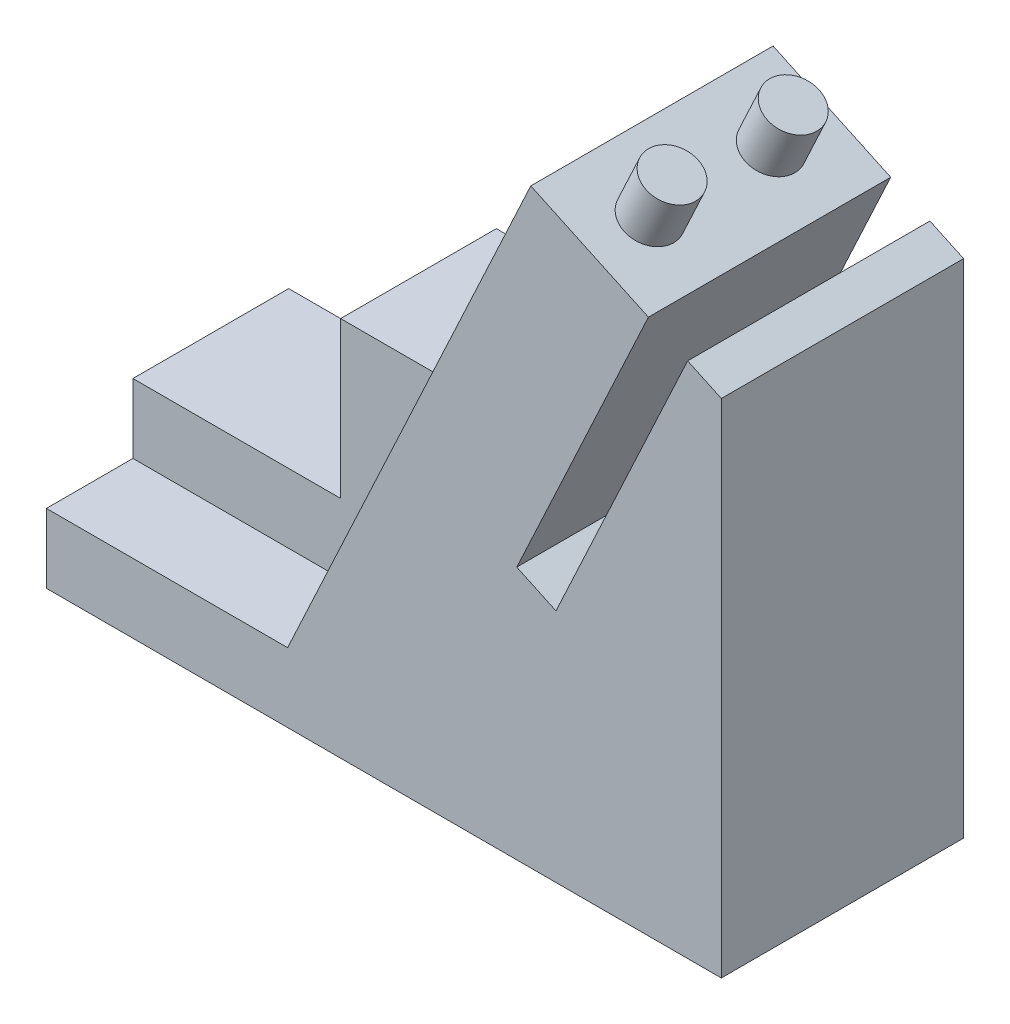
ISO-10303-21;
HEADER;
FILE_DESCRIPTION(('STEP AP214'),'2;1');
FILE_NAME('part.step','',(''),(''),'','','');
FILE_SCHEMA(('AUTOMOTIVE_DESIGN { 1 0 10303 214 1 1 1 1 }'));
ENDSEC;
DATA;
#1=APPLICATION_CONTEXT('core data for automotive mechanical design processes');
#2=APPLICATION_PROTOCOL_DEFINITION('international standard','automotive_design',2000,#1);
#3=PRODUCT_CONTEXT('',#1,'mechanical');
#4=PRODUCT('Part','Part','',(#3));
#5=PRODUCT_RELATED_PRODUCT_CATEGORY('part','',(#4));
#6=PRODUCT_DEFINITION_FORMATION('','',#4);
#7=PRODUCT_DEFINITION_CONTEXT('part definition',#1,'design');
#8=PRODUCT_DEFINITION('design','',#6,#7);
#9=PRODUCT_DEFINITION_SHAPE('','',#8);
#10=(LENGTH_UNIT() NAMED_UNIT(*) SI_UNIT(.MILLI.,.METRE.));
#11=(NAMED_UNIT(*) PLANE_ANGLE_UNIT() SI_UNIT($,.RADIAN.));
#12=(NAMED_UNIT(*) SI_UNIT($,.STERADIAN.) SOLID_ANGLE_UNIT());
#13=UNCERTAINTY_MEASURE_WITH_UNIT(LENGTH_MEASURE(1.E-05),#10,'distance_accuracy_value','');
#14=(GEOMETRIC_REPRESENTATION_CONTEXT(3) GLOBAL_UNCERTAINTY_ASSIGNED_CONTEXT((#13)) GLOBAL_UNIT_ASSIGNED_CONTEXT((#10,
#11,#12)) REPRESENTATION_CONTEXT('',''));
#15=CARTESIAN_POINT('',(0.,0.,0.));
#16=DIRECTION('',(0.,0.,1.));
#17=DIRECTION('',(1.,0.,0.));
#18=AXIS2_PLACEMENT_3D('',#15,#16,#17);
#19=CARTESIAN_POINT('',(78.,58.,28.));
#20=DIRECTION('',(-0.422618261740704,-0.906307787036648,0.));
#21=DIRECTION('',(0.906307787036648,-0.422618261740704,0.));
#22=AXIS2_PLACEMENT_3D('',#19,#20,#21);
#23=PLANE('',#22);
#24=CARTESIAN_POINT('',(62.7768771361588,65.0986587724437,21.));
#25=DIRECTION('',(-0.422618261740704,-0.906307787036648,0.));
#26=DIRECTION('',(0.906307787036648,-0.422618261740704,0.));
#27=AXIS2_PLACEMENT_3D('',#24,#25,#26);
#28=CIRCLE('',#27,2.99999999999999);
#29=CARTESIAN_POINT('',(65.4958004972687,63.8308039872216,21.));
#30=VERTEX_POINT('',#29);
#31=EDGE_CURVE('E11',#30,#30,#28,.F.);
#32=ORIENTED_EDGE('',*,*,#31,.F.);
#33=EDGE_LOOP('',(#32));
#34=FACE_BOUND('',#33,.T.);
#35=CARTESIAN_POINT('',(62.7768771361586,65.0986587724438,7.));
#36=DIRECTION('',(-0.422618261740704,-0.906307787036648,0.));
#37=DIRECTION('',(0.906307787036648,-0.422618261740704,0.));
#38=AXIS2_PLACEMENT_3D('',#35,#36,#37);
#39=CIRCLE('',#38,3.);
#40=CARTESIAN_POINT('',(65.4958004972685,63.8308039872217,7.));
#41=VERTEX_POINT('',#40);
#42=EDGE_CURVE('E52',#41,#41,#39,.F.);
#43=ORIENTED_EDGE('',*,*,#42,.F.);
#44=EDGE_LOOP('',(#43));
#45=FACE_BOUND('',#44,.T.);
#46=DIRECTION('',(-0.906307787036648,0.422618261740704,0.));
#47=VECTOR('',#46,1.);
#48=CARTESIAN_POINT('',(78.,58.,28.));
#49=LINE('',#48,#47);
#50=CARTESIAN_POINT('',(69.5741855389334,61.9290218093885,28.));
#51=VERTEX_POINT('',#50);
#52=CARTESIAN_POINT('',(55.9795687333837,68.2682957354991,28.));
#53=VERTEX_POINT('',#52);
#54=EDGE_CURVE('E219',#51,#53,#49,.T.);
#55=ORIENTED_EDGE('',*,*,#54,.F.);
#56=DIRECTION('',(0.,0.,1.));
#57=VECTOR('',#56,1.);
#58=CARTESIAN_POINT('',(69.5741855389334,61.9290218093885,-0.001000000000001));
#59=LINE('',#58,#57);
#60=CARTESIAN_POINT('',(69.5741855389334,61.9290218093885,0.));
#61=VERTEX_POINT('',#60);
#62=EDGE_CURVE('E200',#61,#51,#59,.T.);
#63=ORIENTED_EDGE('',*,*,#62,.F.);
#64=DIRECTION('',(-0.906307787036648,0.422618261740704,0.));
#65=VECTOR('',#64,1.);
#66=CARTESIAN_POINT('',(78.,58.,0.));
#67=LINE('',#66,#65);
#68=CARTESIAN_POINT('',(55.9795687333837,68.2682957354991,0.));
#69=VERTEX_POINT('',#68);
#70=EDGE_CURVE('E237',#61,#69,#67,.T.);
#71=ORIENTED_EDGE('',*,*,#70,.T.);
#72=DIRECTION('',(0.,0.,-1.));
#73=VECTOR('',#72,1.);
#74=CARTESIAN_POINT('',(55.9795687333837,68.2682957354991,28.));
#75=LINE('',#74,#73);
#76=EDGE_CURVE('E268',#53,#69,#75,.T.);
#77=ORIENTED_EDGE('',*,*,#76,.F.);
#78=EDGE_LOOP('',(#55,#63,#71,#77));
#79=FACE_BOUND('',#78,.T.);
#80=ADVANCED_FACE('F43',(#34,#45,#79),#23,.F.);
#81=CARTESIAN_POINT('',(0.,16.,28.));
#82=DIRECTION('',(1.,0.,0.));
#83=DIRECTION('',(0.,1.,0.));
#84=AXIS2_PLACEMENT_3D('',#81,#82,#83);
#85=PLANE('',#84);
#86=DIRECTION('',(0.,-1.,0.));
#87=VECTOR('',#86,1.);
#88=CARTESIAN_POINT('',(0.,16.,28.));
#89=LINE('',#88,#87);
#90=CARTESIAN_POINT('',(0.,8.,28.));
#91=VERTEX_POINT('',#90);
#92=CARTESIAN_POINT('',(0.,0.,28.));
#93=VERTEX_POINT('',#92);
#94=EDGE_CURVE('E167',#91,#93,#89,.T.);
#95=ORIENTED_EDGE('',*,*,#94,.F.);
#96=DIRECTION('',(0.,0.,1.));
#97=VECTOR('',#96,1.);
#98=CARTESIAN_POINT('',(0.,8.,18.));
#99=LINE('',#98,#97);
#100=CARTESIAN_POINT('',(0.,8.,18.));
#101=VERTEX_POINT('',#100);
#102=EDGE_CURVE('E59',#101,#91,#99,.T.);
#103=ORIENTED_EDGE('',*,*,#102,.F.);
#104=DIRECTION('',(0.,-1.,0.));
#105=VECTOR('',#104,1.);
#106=CARTESIAN_POINT('',(0.,8.,18.));
#107=LINE('',#106,#105);
#108=CARTESIAN_POINT('',(0.,16.,18.));
#109=VERTEX_POINT('',#108);
#110=EDGE_CURVE('E154',#109,#101,#107,.T.);
#111=ORIENTED_EDGE('',*,*,#110,.F.);
#112=DIRECTION('',(0.,0.,-1.));
#113=VECTOR('',#112,1.);
#114=CARTESIAN_POINT('',(0.,16.,28.));
#115=LINE('',#114,#113);
#116=CARTESIAN_POINT('',(0.,16.,0.));
#117=VERTEX_POINT('',#116);
#118=EDGE_CURVE('E227',#109,#117,#115,.T.);
#119=ORIENTED_EDGE('',*,*,#118,.T.);
#120=DIRECTION('',(0.,-1.,0.));
#121=VECTOR('',#120,1.);
#122=CARTESIAN_POINT('',(0.,16.,0.));
#123=LINE('',#122,#121);
#124=CARTESIAN_POINT('',(0.,0.,0.));
#125=VERTEX_POINT('',#124);
#126=EDGE_CURVE('E209',#117,#125,#123,.T.);
#127=ORIENTED_EDGE('',*,*,#126,.T.);
#128=DIRECTION('',(0.,0.,-1.));
#129=VECTOR('',#128,1.);
#130=CARTESIAN_POINT('',(0.,0.,28.));
#131=LINE('',#130,#129);
#132=EDGE_CURVE('E280',#93,#125,#131,.T.);
#133=ORIENTED_EDGE('',*,*,#132,.F.);
#134=EDGE_LOOP('',(#95,#103,#111,#119,#127,#133));
#135=FACE_BOUND('',#134,.T.);
#136=ADVANCED_FACE('F45',(#135),#85,.F.);
#137=CARTESIAN_POINT('',(0.,0.,28.));
#138=DIRECTION('',(0.,1.,0.));
#139=DIRECTION('',(0.,0.,1.));
#140=AXIS2_PLACEMENT_3D('',#137,#138,#139);
#141=PLANE('',#140);
#142=DIRECTION('',(1.,0.,0.));
#143=VECTOR('',#142,1.);
#144=CARTESIAN_POINT('',(0.,0.,0.));
#145=LINE('',#144,#143);
#146=CARTESIAN_POINT('',(78.,0.,0.));
#147=VERTEX_POINT('',#146);
#148=EDGE_CURVE('E231',#125,#147,#145,.T.);
#149=ORIENTED_EDGE('',*,*,#148,.T.);
#150=DIRECTION('',(0.,0.,-1.));
#151=VECTOR('',#150,1.);
#152=CARTESIAN_POINT('',(78.,0.,28.));
#153=LINE('',#152,#151);
#154=CARTESIAN_POINT('',(78.,0.,28.));
#155=VERTEX_POINT('',#154);
#156=EDGE_CURVE('E276',#155,#147,#153,.T.);
#157=ORIENTED_EDGE('',*,*,#156,.F.);
#158=DIRECTION('',(1.,0.,0.));
#159=VECTOR('',#158,1.);
#160=CARTESIAN_POINT('',(0.,0.,28.));
#161=LINE('',#160,#159);
#162=EDGE_CURVE('E212',#93,#155,#161,.T.);
#163=ORIENTED_EDGE('',*,*,#162,.F.);
#164=ORIENTED_EDGE('',*,*,#132,.T.);
#165=EDGE_LOOP('',(#149,#157,#163,#164));
#166=FACE_BOUND('',#165,.T.);
#167=ADVANCED_FACE('F391',(#166),#141,.F.);
#168=CARTESIAN_POINT('',(78.,0.,28.));
#169=DIRECTION('',(-1.,0.,0.));
#170=DIRECTION('',(0.,0.,1.));
#171=AXIS2_PLACEMENT_3D('',#168,#169,#170);
#172=PLANE('',#171);
#173=DIRECTION('',(0.,1.,0.));
#174=VECTOR('',#173,1.);
#175=CARTESIAN_POINT('',(78.,0.,0.));
#176=LINE('',#175,#174);
#177=CARTESIAN_POINT('',(78.,58.,0.));
#178=VERTEX_POINT('',#177);
#179=EDGE_CURVE('E234',#147,#178,#176,.T.);
#180=ORIENTED_EDGE('',*,*,#179,.T.);
#181=DIRECTION('',(0.,0.,-1.));
#182=VECTOR('',#181,1.);
#183=CARTESIAN_POINT('',(78.,58.,28.));
#184=LINE('',#183,#182);
#185=CARTESIAN_POINT('',(78.,58.,28.));
#186=VERTEX_POINT('',#185);
#187=EDGE_CURVE('E272',#186,#178,#184,.T.);
#188=ORIENTED_EDGE('',*,*,#187,.F.);
#189=DIRECTION('',(0.,1.,0.));
#190=VECTOR('',#189,1.);
#191=CARTESIAN_POINT('',(78.,0.,28.));
#192=LINE('',#191,#190);
#193=EDGE_CURVE('E216',#155,#186,#192,.T.);
#194=ORIENTED_EDGE('',*,*,#193,.F.);
#195=ORIENTED_EDGE('',*,*,#156,.T.);
#196=EDGE_LOOP('',(#180,#188,#194,#195));
#197=FACE_BOUND('',#196,.T.);
#198=ADVANCED_FACE('F388',(#197),#172,.F.);
#199=CARTESIAN_POINT('',(74.1057244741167,59.815930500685,0.));
#200=VERTEX_POINT('',#199);
#201=EDGE_CURVE('E238',#178,#200,#67,.T.);
#202=ORIENTED_EDGE('',*,*,#201,.T.);
#203=DIRECTION('',(0.,0.,1.));
#204=VECTOR('',#203,1.);
#205=CARTESIAN_POINT('',(74.1057244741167,59.815930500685,-0.001000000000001));
#206=LINE('',#205,#204);
#207=CARTESIAN_POINT('',(74.1057244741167,59.815930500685,28.));
#208=VERTEX_POINT('',#207);
#209=EDGE_CURVE('E67',#200,#208,#206,.T.);
#210=ORIENTED_EDGE('',*,*,#209,.T.);
#211=EDGE_CURVE('E220',#186,#208,#49,.T.);
#212=ORIENTED_EDGE('',*,*,#211,.F.);
#213=ORIENTED_EDGE('',*,*,#187,.T.);
#214=EDGE_LOOP('',(#202,#210,#212,#213));
#215=FACE_BOUND('',#214,.T.);
#216=ADVANCED_FACE('F293',(#215),#23,.F.);
#217=CARTESIAN_POINT('',(55.9795687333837,68.2682957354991,28.));
#218=DIRECTION('',(0.906307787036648,-0.422618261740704,0.));
#219=DIRECTION('',(0.422618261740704,0.906307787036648,0.));
#220=AXIS2_PLACEMENT_3D('',#217,#218,#219);
#221=PLANE('',#220);
#222=DIRECTION('',(-0.422618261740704,-0.906307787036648,0.));
#223=VECTOR('',#222,1.);
#224=CARTESIAN_POINT('',(55.9795687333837,68.2682957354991,0.));
#225=LINE('',#224,#223);
#226=CARTESIAN_POINT('',(40.,34.,0.));
#227=VERTEX_POINT('',#226);
#228=EDGE_CURVE('E242',#69,#227,#225,.T.);
#229=ORIENTED_EDGE('',*,*,#228,.T.);
#230=DIRECTION('',(0.,0.,-1.));
#231=VECTOR('',#230,1.);
#232=CARTESIAN_POINT('',(40.,34.,28.));
#233=LINE('',#232,#231);
#234=CARTESIAN_POINT('',(40.,34.,18.));
#235=VERTEX_POINT('',#234);
#236=EDGE_CURVE('E265',#235,#227,#233,.T.);
#237=ORIENTED_EDGE('',*,*,#236,.F.);
#238=DIRECTION('',(0.422618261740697,0.906307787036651,0.));
#239=VECTOR('',#238,1.);
#240=CARTESIAN_POINT('',(27.8760008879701,8.,18.));
#241=LINE('',#240,#239);
#242=CARTESIAN_POINT('',(27.8760008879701,8.,18.));
#243=VERTEX_POINT('',#242);
#244=EDGE_CURVE('E153',#243,#235,#241,.T.);
#245=ORIENTED_EDGE('',*,*,#244,.F.);
#246=DIRECTION('',(0.,0.,1.));
#247=VECTOR('',#246,1.);
#248=CARTESIAN_POINT('',(27.8760008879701,8.,18.));
#249=LINE('',#248,#247);
#250=CARTESIAN_POINT('',(27.8760008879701,8.,28.));
#251=VERTEX_POINT('',#250);
#252=EDGE_CURVE('E149',#243,#251,#249,.T.);
#253=ORIENTED_EDGE('',*,*,#252,.T.);
#254=DIRECTION('',(-0.422618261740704,-0.906307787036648,0.));
#255=VECTOR('',#254,1.);
#256=CARTESIAN_POINT('',(55.9795687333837,68.2682957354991,28.));
#257=LINE('',#256,#255);
#258=EDGE_CURVE('E224',#53,#251,#257,.T.);
#259=ORIENTED_EDGE('',*,*,#258,.F.);
#260=ORIENTED_EDGE('',*,*,#76,.T.);
#261=EDGE_LOOP('',(#229,#237,#245,#253,#259,#260));
#262=FACE_BOUND('',#261,.T.);
#263=ADVANCED_FACE('F307',(#262),#221,.F.);
#264=CARTESIAN_POINT('',(40.,34.,28.));
#265=DIRECTION('',(0.,-1.,0.));
#266=DIRECTION('',(0.,0.,-1.));
#267=AXIS2_PLACEMENT_3D('',#264,#265,#266);
#268=PLANE('',#267);
#269=DIRECTION('',(0.,0.,-1.));
#270=VECTOR('',#269,1.);
#271=CARTESIAN_POINT('',(24.,34.,28.));
#272=LINE('',#271,#270);
#273=CARTESIAN_POINT('',(24.,34.,18.));
#274=VERTEX_POINT('',#273);
#275=CARTESIAN_POINT('',(24.,34.,0.));
#276=VERTEX_POINT('',#275);
#277=EDGE_CURVE('E262',#274,#276,#272,.T.);
#278=ORIENTED_EDGE('',*,*,#277,.F.);
#279=DIRECTION('',(-1.,0.,0.));
#280=VECTOR('',#279,1.);
#281=CARTESIAN_POINT('',(24.,34.,18.));
#282=LINE('',#281,#280);
#283=EDGE_CURVE('E317',#235,#274,#282,.T.);
#284=ORIENTED_EDGE('',*,*,#283,.F.);
#285=ORIENTED_EDGE('',*,*,#236,.T.);
#286=DIRECTION('',(-1.,0.,0.));
#287=VECTOR('',#286,1.);
#288=CARTESIAN_POINT('',(40.,34.,0.));
#289=LINE('',#288,#287);
#290=EDGE_CURVE('E246',#227,#276,#289,.T.);
#291=ORIENTED_EDGE('',*,*,#290,.T.);
#292=EDGE_LOOP('',(#278,#284,#285,#291));
#293=FACE_BOUND('',#292,.T.);
#294=ADVANCED_FACE('F315',(#293),#268,.F.);
#295=CARTESIAN_POINT('',(24.,34.,28.));
#296=DIRECTION('',(1.,0.,0.));
#297=DIRECTION('',(0.,0.,-1.));
#298=AXIS2_PLACEMENT_3D('',#295,#296,#297);
#299=PLANE('',#298);
#300=DIRECTION('',(0.,0.,-1.));
#301=VECTOR('',#300,1.);
#302=CARTESIAN_POINT('',(24.,16.,28.));
#303=LINE('',#302,#301);
#304=CARTESIAN_POINT('',(24.,16.,18.));
#305=VERTEX_POINT('',#304);
#306=CARTESIAN_POINT('',(24.,16.,0.));
#307=VERTEX_POINT('',#306);
#308=EDGE_CURVE('E259',#305,#307,#303,.T.);
#309=ORIENTED_EDGE('',*,*,#308,.F.);
#310=DIRECTION('',(0.,-1.,0.));
#311=VECTOR('',#310,1.);
#312=CARTESIAN_POINT('',(24.,16.,18.));
#313=LINE('',#312,#311);
#314=EDGE_CURVE('E174',#274,#305,#313,.T.);
#315=ORIENTED_EDGE('',*,*,#314,.F.);
#316=ORIENTED_EDGE('',*,*,#277,.T.);
#317=DIRECTION('',(0.,-1.,0.));
#318=VECTOR('',#317,1.);
#319=CARTESIAN_POINT('',(24.,34.,0.));
#320=LINE('',#319,#318);
#321=EDGE_CURVE('E250',#276,#307,#320,.T.);
#322=ORIENTED_EDGE('',*,*,#321,.T.);
#323=EDGE_LOOP('',(#309,#315,#316,#322));
#324=FACE_BOUND('',#323,.T.);
#325=ADVANCED_FACE('F378',(#324),#299,.F.);
#326=CARTESIAN_POINT('',(24.,16.,28.));
#327=DIRECTION('',(0.,-1.,0.));
#328=DIRECTION('',(1.,0.,0.));
#329=AXIS2_PLACEMENT_3D('',#326,#327,#328);
#330=PLANE('',#329);
#331=ORIENTED_EDGE('',*,*,#118,.F.);
#332=DIRECTION('',(-1.,0.,0.));
#333=VECTOR('',#332,1.);
#334=CARTESIAN_POINT('',(0.,16.,18.));
#335=LINE('',#334,#333);
#336=EDGE_CURVE('E159',#305,#109,#335,.T.);
#337=ORIENTED_EDGE('',*,*,#336,.F.);
#338=ORIENTED_EDGE('',*,*,#308,.T.);
#339=DIRECTION('',(-1.,0.,0.));
#340=VECTOR('',#339,1.);
#341=CARTESIAN_POINT('',(24.,16.,0.));
#342=LINE('',#341,#340);
#343=EDGE_CURVE('E213',#307,#117,#342,.T.);
#344=ORIENTED_EDGE('',*,*,#343,.T.);
#345=EDGE_LOOP('',(#331,#337,#338,#344));
#346=FACE_BOUND('',#345,.T.);
#347=ADVANCED_FACE('F373',(#346),#330,.F.);
#348=CARTESIAN_POINT('',(0.,0.,28.));
#349=DIRECTION('',(0.,0.,1.));
#350=DIRECTION('',(1.,0.,0.));
#351=AXIS2_PLACEMENT_3D('',#348,#349,#350);
#352=PLANE('',#351);
#353=ORIENTED_EDGE('',*,*,#258,.T.);
#354=DIRECTION('',(1.,0.,0.));
#355=VECTOR('',#354,1.);
#356=CARTESIAN_POINT('',(0.,8.,28.));
#357=LINE('',#356,#355);
#358=EDGE_CURVE('E163',#91,#251,#357,.T.);
#359=ORIENTED_EDGE('',*,*,#358,.F.);
#360=ORIENTED_EDGE('',*,*,#94,.T.);
#361=ORIENTED_EDGE('',*,*,#162,.T.);
#362=ORIENTED_EDGE('',*,*,#193,.T.);
#363=ORIENTED_EDGE('',*,*,#211,.T.);
#364=DIRECTION('',(0.422618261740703,0.906307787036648,0.));
#365=VECTOR('',#364,1.);
#366=CARTESIAN_POINT('',(37.9591524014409,-17.7006434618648,28.));
#367=LINE('',#366,#365);
#368=CARTESIAN_POINT('',(58.8914670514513,27.1888501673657,28.));
#369=VERTEX_POINT('',#368);
#370=EDGE_CURVE('E188',#369,#208,#367,.T.);
#371=ORIENTED_EDGE('',*,*,#370,.F.);
#372=DIRECTION('',(0.906307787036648,-0.422618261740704,0.));
#373=VECTOR('',#372,1.);
#374=CARTESIAN_POINT('',(20.9323146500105,44.8894936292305,28.));
#375=LINE('',#374,#373);
#376=CARTESIAN_POINT('',(54.3599281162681,29.3019414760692,28.));
#377=VERTEX_POINT('',#376);
#378=EDGE_CURVE('E184',#377,#369,#375,.T.);
#379=ORIENTED_EDGE('',*,*,#378,.F.);
#380=DIRECTION('',(-0.422618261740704,-0.906307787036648,0.));
#381=VECTOR('',#380,1.);
#382=CARTESIAN_POINT('',(33.4276134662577,-15.5875521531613,28.));
#383=LINE('',#382,#381);
#384=EDGE_CURVE('E191',#51,#377,#383,.T.);
#385=ORIENTED_EDGE('',*,*,#384,.F.);
#386=ORIENTED_EDGE('',*,*,#54,.T.);
#387=EDGE_LOOP('',(#353,#359,#360,#361,#362,#363,#371,#379,#385,#386));
#388=FACE_BOUND('',#387,.T.);
#389=ADVANCED_FACE('F370',(#388),#352,.T.);
#390=CARTESIAN_POINT('',(0.,0.,0.));
#391=DIRECTION('',(0.,0.,1.));
#392=DIRECTION('',(1.,0.,0.));
#393=AXIS2_PLACEMENT_3D('',#390,#391,#392);
#394=PLANE('',#393);
#395=ORIENTED_EDGE('',*,*,#70,.F.);
#396=DIRECTION('',(0.422618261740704,0.906307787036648,0.));
#397=VECTOR('',#396,1.);
#398=CARTESIAN_POINT('',(33.4276134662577,-15.5875521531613,0.));
#399=LINE('',#398,#397);
#400=CARTESIAN_POINT('',(54.3599281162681,29.3019414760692,0.));
#401=VERTEX_POINT('',#400);
#402=EDGE_CURVE('E181',#401,#61,#399,.T.);
#403=ORIENTED_EDGE('',*,*,#402,.F.);
#404=DIRECTION('',(-0.906307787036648,0.422618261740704,0.));
#405=VECTOR('',#404,1.);
#406=CARTESIAN_POINT('',(20.9323146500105,44.8894936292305,0.));
#407=LINE('',#406,#405);
#408=CARTESIAN_POINT('',(58.8914670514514,27.1888501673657,0.));
#409=VERTEX_POINT('',#408);
#410=EDGE_CURVE('E172',#409,#401,#407,.T.);
#411=ORIENTED_EDGE('',*,*,#410,.F.);
#412=DIRECTION('',(-0.422618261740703,-0.906307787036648,0.));
#413=VECTOR('',#412,1.);
#414=CARTESIAN_POINT('',(37.9591524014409,-17.7006434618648,0.));
#415=LINE('',#414,#413);
#416=EDGE_CURVE('E199',#200,#409,#415,.T.);
#417=ORIENTED_EDGE('',*,*,#416,.F.);
#418=ORIENTED_EDGE('',*,*,#201,.F.);
#419=ORIENTED_EDGE('',*,*,#179,.F.);
#420=ORIENTED_EDGE('',*,*,#148,.F.);
#421=ORIENTED_EDGE('',*,*,#126,.F.);
#422=ORIENTED_EDGE('',*,*,#343,.F.);
#423=ORIENTED_EDGE('',*,*,#321,.F.);
#424=ORIENTED_EDGE('',*,*,#290,.F.);
#425=ORIENTED_EDGE('',*,*,#228,.F.);
#426=EDGE_LOOP('',(#395,#403,#411,#417,#418,#419,#420,#421,#422,#423,#424,#425));
#427=FACE_BOUND('',#426,.T.);
#428=ADVANCED_FACE('F310',(#427),#394,.F.);
#429=CARTESIAN_POINT('',(20.9323146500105,44.8894936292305,-0.001000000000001));
#430=DIRECTION('',(-0.422618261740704,-0.906307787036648,0.));
#431=DIRECTION('',(0.906307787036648,-0.422618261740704,0.));
#432=AXIS2_PLACEMENT_3D('',#429,#430,#431);
#433=PLANE('',#432);
#434=ORIENTED_EDGE('',*,*,#410,.T.);
#435=DIRECTION('',(0.,0.,1.));
#436=VECTOR('',#435,1.);
#437=CARTESIAN_POINT('',(54.3599281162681,29.3019414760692,-0.001000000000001));
#438=LINE('',#437,#436);
#439=EDGE_CURVE('E196',#401,#377,#438,.T.);
#440=ORIENTED_EDGE('',*,*,#439,.T.);
#441=ORIENTED_EDGE('',*,*,#378,.T.);
#442=DIRECTION('',(0.,0.,1.));
#443=VECTOR('',#442,1.);
#444=CARTESIAN_POINT('',(58.8914670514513,27.1888501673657,-0.001000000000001));
#445=LINE('',#444,#443);
#446=EDGE_CURVE('E195',#409,#369,#445,.T.);
#447=ORIENTED_EDGE('',*,*,#446,.F.);
#448=EDGE_LOOP('',(#434,#440,#441,#447));
#449=FACE_BOUND('',#448,.T.);
#450=ADVANCED_FACE('F363',(#449),#433,.F.);
#451=CARTESIAN_POINT('',(33.4276134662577,-15.5875521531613,-0.001000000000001));
#452=DIRECTION('',(-0.906307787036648,0.422618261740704,0.));
#453=DIRECTION('',(-0.422618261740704,-0.906307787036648,0.));
#454=AXIS2_PLACEMENT_3D('',#451,#452,#453);
#455=PLANE('',#454);
#456=ORIENTED_EDGE('',*,*,#402,.T.);
#457=ORIENTED_EDGE('',*,*,#62,.T.);
#458=ORIENTED_EDGE('',*,*,#384,.T.);
#459=ORIENTED_EDGE('',*,*,#439,.F.);
#460=EDGE_LOOP('',(#456,#457,#458,#459));
#461=FACE_BOUND('',#460,.T.);
#462=ADVANCED_FACE('F360',(#461),#455,.F.);
#463=CARTESIAN_POINT('',(37.9591524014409,-17.7006434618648,-0.001000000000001));
#464=DIRECTION('',(0.906307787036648,-0.422618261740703,0.));
#465=DIRECTION('',(0.422618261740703,0.906307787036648,0.));
#466=AXIS2_PLACEMENT_3D('',#463,#464,#465);
#467=PLANE('',#466);
#468=ORIENTED_EDGE('',*,*,#416,.T.);
#469=ORIENTED_EDGE('',*,*,#446,.T.);
#470=ORIENTED_EDGE('',*,*,#370,.T.);
#471=ORIENTED_EDGE('',*,*,#209,.F.);
#472=EDGE_LOOP('',(#468,#469,#470,#471));
#473=FACE_BOUND('',#472,.T.);
#474=ADVANCED_FACE('F359',(#473),#467,.F.);
#475=CARTESIAN_POINT('',(0.,8.,18.));
#476=DIRECTION('',(0.,-1.,0.));
#477=DIRECTION('',(0.,0.,-1.));
#478=AXIS2_PLACEMENT_3D('',#475,#476,#477);
#479=PLANE('',#478);
#480=ORIENTED_EDGE('',*,*,#358,.T.);
#481=ORIENTED_EDGE('',*,*,#252,.F.);
#482=DIRECTION('',(1.,0.,0.));
#483=VECTOR('',#482,1.);
#484=CARTESIAN_POINT('',(0.,8.,18.));
#485=LINE('',#484,#483);
#486=EDGE_CURVE('E145',#101,#243,#485,.T.);
#487=ORIENTED_EDGE('',*,*,#486,.F.);
#488=ORIENTED_EDGE('',*,*,#102,.T.);
#489=EDGE_LOOP('',(#480,#481,#487,#488));
#490=FACE_BOUND('',#489,.T.);
#491=ADVANCED_FACE('F147',(#490),#479,.F.);
#492=CARTESIAN_POINT('',(0.,0.,18.));
#493=DIRECTION('',(0.,0.,-1.));
#494=DIRECTION('',(-1.,0.,0.));
#495=AXIS2_PLACEMENT_3D('',#492,#493,#494);
#496=PLANE('',#495);
#497=ORIENTED_EDGE('',*,*,#110,.T.);
#498=ORIENTED_EDGE('',*,*,#486,.T.);
#499=ORIENTED_EDGE('',*,*,#244,.T.);
#500=ORIENTED_EDGE('',*,*,#283,.T.);
#501=ORIENTED_EDGE('',*,*,#314,.T.);
#502=ORIENTED_EDGE('',*,*,#336,.T.);
#503=EDGE_LOOP('',(#497,#498,#499,#500,#501,#502));
#504=FACE_BOUND('',#503,.T.);
#505=ADVANCED_FACE('F157',(#504),#496,.F.);
#506=CARTESIAN_POINT('',(65.3125867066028,70.5365054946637,7.));
#507=DIRECTION('',(-0.422618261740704,-0.906307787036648,0.));
#508=DIRECTION('',(0.906307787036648,-0.422618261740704,0.));
#509=AXIS2_PLACEMENT_3D('',#506,#507,#508);
#510=CYLINDRICAL_SURFACE('',#509,3.);
#511=CARTESIAN_POINT('',(65.3125867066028,70.5365054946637,7.));
#512=DIRECTION('',(0.422618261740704,0.906307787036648,0.));
#513=DIRECTION('',(-0.906307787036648,0.422618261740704,0.));
#514=AXIS2_PLACEMENT_3D('',#511,#512,#513);
#515=CIRCLE('',#514,3.);
#516=CARTESIAN_POINT('',(62.5936633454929,71.8043602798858,7.));
#517=VERTEX_POINT('',#516);
#518=EDGE_CURVE('E325',#517,#517,#515,.T.);
#519=ORIENTED_EDGE('',*,*,#518,.F.);
#520=EDGE_LOOP('',(#519));
#521=FACE_BOUND('',#520,.T.);
#522=ORIENTED_EDGE('',*,*,#42,.T.);
#523=EDGE_LOOP('',(#522));
#524=FACE_BOUND('',#523,.T.);
#525=ADVANCED_FACE('F287',(#521,#524),#510,.T.);
#526=CARTESIAN_POINT('',(65.3125867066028,70.5365054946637,7.));
#527=DIRECTION('',(0.422618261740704,0.906307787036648,0.));
#528=DIRECTION('',(-0.906307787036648,0.422618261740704,0.));
#529=AXIS2_PLACEMENT_3D('',#526,#527,#528);
#530=PLANE('',#529);
#531=ORIENTED_EDGE('',*,*,#518,.T.);
#532=EDGE_LOOP('',(#531));
#533=FACE_BOUND('',#532,.T.);
#534=ADVANCED_FACE('F342',(#533),#530,.T.);
#535=CARTESIAN_POINT('',(65.312586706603,70.5365054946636,21.));
#536=DIRECTION('',(-0.422618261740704,-0.906307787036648,0.));
#537=DIRECTION('',(0.906307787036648,-0.422618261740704,0.));
#538=AXIS2_PLACEMENT_3D('',#535,#536,#537);
#539=CYLINDRICAL_SURFACE('',#538,2.99999999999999);
#540=CARTESIAN_POINT('',(65.312586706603,70.5365054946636,21.));
#541=DIRECTION('',(0.422618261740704,0.906307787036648,0.));
#542=DIRECTION('',(-0.906307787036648,0.422618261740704,0.));
#543=AXIS2_PLACEMENT_3D('',#540,#541,#542);
#544=CIRCLE('',#543,2.99999999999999);
#545=CARTESIAN_POINT('',(62.5936633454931,71.8043602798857,21.));
#546=VERTEX_POINT('',#545);
#547=EDGE_CURVE('E328',#546,#546,#544,.T.);
#548=ORIENTED_EDGE('',*,*,#547,.F.);
#549=EDGE_LOOP('',(#548));
#550=FACE_BOUND('',#549,.T.);
#551=ORIENTED_EDGE('',*,*,#31,.T.);
#552=EDGE_LOOP('',(#551));
#553=FACE_BOUND('',#552,.T.);
#554=ADVANCED_FACE('F339',(#550,#553),#539,.T.);
#555=CARTESIAN_POINT('',(65.312586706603,70.5365054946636,21.));
#556=DIRECTION('',(0.422618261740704,0.906307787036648,0.));
#557=DIRECTION('',(-0.906307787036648,0.422618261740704,0.));
#558=AXIS2_PLACEMENT_3D('',#555,#556,#557);
#559=PLANE('',#558);
#560=ORIENTED_EDGE('',*,*,#547,.T.);
#561=EDGE_LOOP('',(#560));
#562=FACE_BOUND('',#561,.T.);
#563=ADVANCED_FACE('F337',(#562),#559,.T.);
#564=CLOSED_SHELL('',(#80,#136,#167,#198,#216,#263,#294,#325,#347,#389,#428,#450,#462,#474,#491,
#505,#525,#534,#554,#563));
#565=MANIFOLD_SOLID_BREP('B2',#564);
#566=ADVANCED_BREP_SHAPE_REPRESENTATION('',(#18,#565),#14);
#567=SHAPE_DEFINITION_REPRESENTATION(#9,#566);
ENDSEC;
END-ISO-10303-21;
